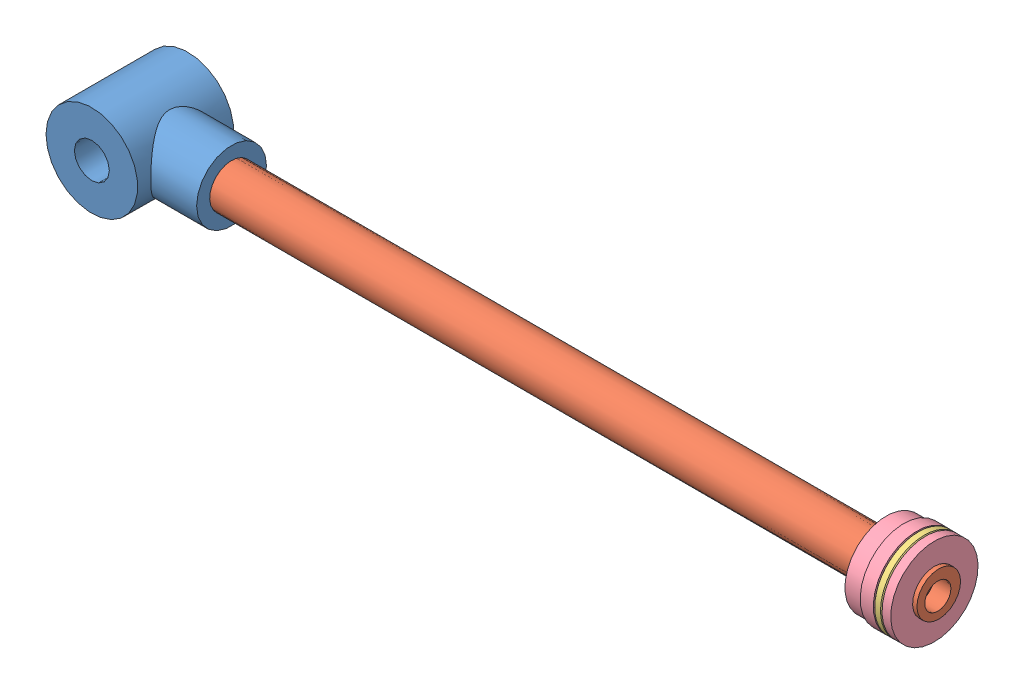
SolidWorks assembly Ensemble_tige.SLDASM, configuration Défaut (file format 11000). Lengths in mm.
Overall size (193.5 28.28 28.28).
4 component instances, 4 part files, 6 mates.
Components (placement in the parent):
- Tige_verin_embout-1: Tige_verin_embout.sldprt [Défaut] at (0.0079 -0.0168 0) size (31.5 21 22)
- Tige_verin_seule-1: Tige_verin_seule.sldprt [Défaut] at (71.0079 -0.0168 11) x (-1 0 0) z (0 0.035372 -0.999374) size (172 10 10)
- Joint_piston-1: Joint_piston.sldprt [Défaut] at (179.0079 -0.0168 11) size (2.97 20 20)
- Piston_verin-1: Piston_verin.sldprt [Défaut] at (182.0079 -0.0168 11) x (-1 0 0) z (0 0.711521 0.702665) size (11 20 20)
Mates (geometry in assembly coordinates):
- Coïncidente1: coincident: circle of assembly
- Coïncidente2: coincident: plane of Tige_verin_embout-1 through (11.0079 -5.1159 16.0903) normal (1 0 0); plane of Tige_verin_seule-1 through (11.0079 -5.2928 15.9068) normal (-1 0 0)
- Coïncidente3: coincident: plane of Tige_verin_seule-1 through (171.0079 -4.9337 5.7626) normal (1 0 0); plane of Piston_verin-1 through (171.0079 -0.0907 -2.6893) normal (-1 0 0)
- Coaxiale2: concentric: cylinder of Tige_verin_seule-1 through (171.0079 -0.0168 11) axis (1 0 0) radius 4; cylinder of Piston_verin-1 through (171.0079 -0.0168 11) axis (1 0 0) radius 4
- Coaxiale3: concentric: circle of Joint_piston-1; circle of Piston_verin-1
- Tangent2: tangent: face of Joint_piston-1; plane of Piston_verin-1 through (178.0079 14.35 10.855) normal (1 0 0)
